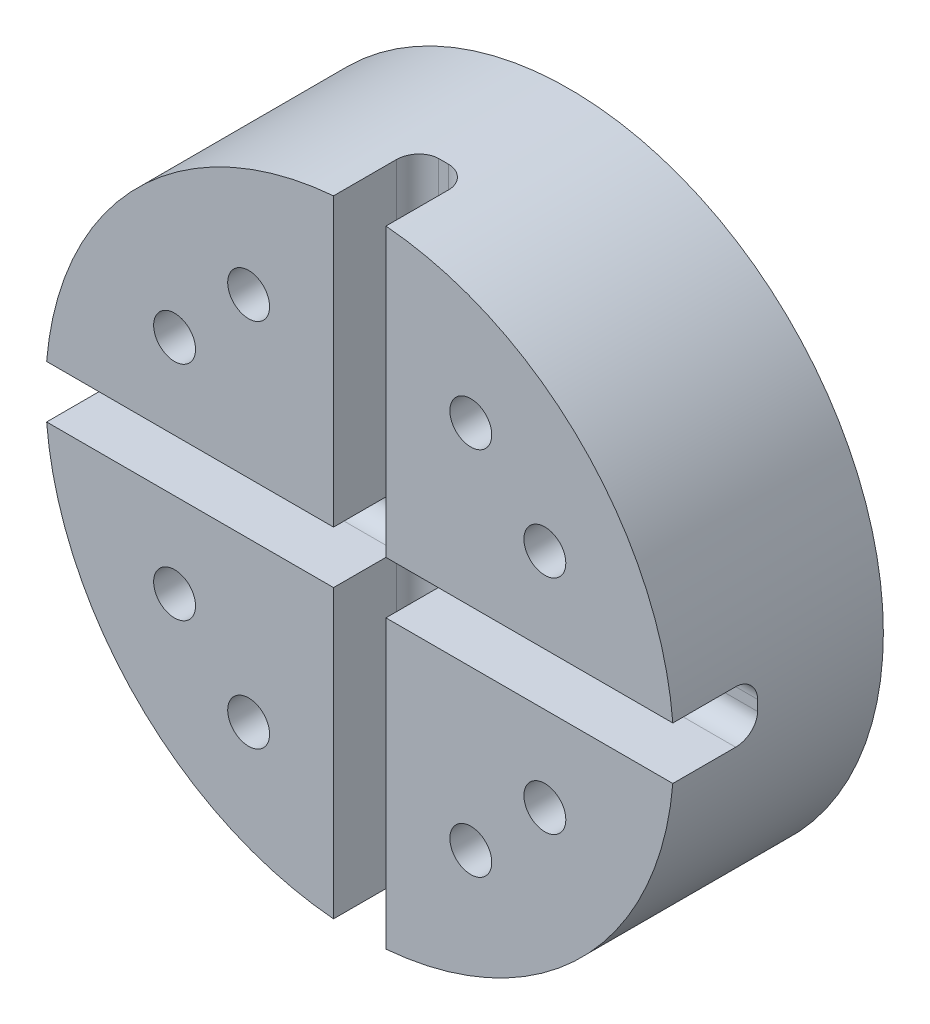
from build123d import *

# Parameters (mm, degrees)
SKETCH2_R           = 15
BOSS_EXTRUDE1_DEPTH = 10
CUT_EXTRUDE1_DEPTH  = 4
FILLET1_R           = 1
SKETCH4_R           = 1
CUT_EXTRUDE2_DEPTH  = 10
CIRPATTERN1_COUNT   = 4


with BuildPart() as part:
    # Sketch2 → Boss-Extrude1 (new body)
    with BuildSketch(Plane.XY):
        Circle(SKETCH2_R)
    extrude(amount=BOSS_EXTRUDE1_DEPTH)

    # Sketch3 → Cut-Extrude1 (cut)
    with BuildSketch(Plane.XY.offset(10)):
        Polygon((-1.25, 1.25), (-1.25, 15.296025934), (1.25, 15.296025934), (1.25, 1.25), (15.674686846, 1.25), (15.674686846, -1.25), (1.25, -1.25), (1.25, -15.629214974), (-1.25, -15.629214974), (-1.25, -1.25), (-15.410512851, -1.25), (-15.410512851, 1.25), align=None)
    extrude(amount=-CUT_EXTRUDE1_DEPTH, mode=Mode.SUBTRACT)

    # Fillet1
    fillet1_edges = [part.edges().sort_by_distance(p)[0] for p in [
        (-8.098912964, 1.25, 6),
        (-1.25, 8.098912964, 6),
        (1.25, 8.098912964, 6),
        (8.098912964, 1.25, 6),
        (8.098912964, -1.25, 6),
        (1.25, -8.098912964, 6),
        (-1.25, -8.098912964, 6),
        (-8.098912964, -1.25, 6),
    ]]
    fillet(fillet1_edges, radius=FILLET1_R)

    # Sketch4 → Cut-Extrude2 (cut)
    with BuildSketch(Plane.XY.offset(10)):
        with Locations((-5.303300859, 8.838834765)):
            Circle(SKETCH4_R)
        with Locations((-8.838834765, 5.303300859)):
            Circle(SKETCH4_R)
    cut_extrude2 = extrude(amount=-CUT_EXTRUDE2_DEPTH, mode=Mode.SUBTRACT)

    # CirPattern1: Cut-Extrude2 ×4 about axis
    cirpattern1_axis = Axis((0, 0, 0), (0, 0, 1))
    for i in range(1, CIRPATTERN1_COUNT):
        add(cut_extrude2.rotate(cirpattern1_axis, i * 360 / CIRPATTERN1_COUNT), mode=Mode.SUBTRACT)


solid = part.part
